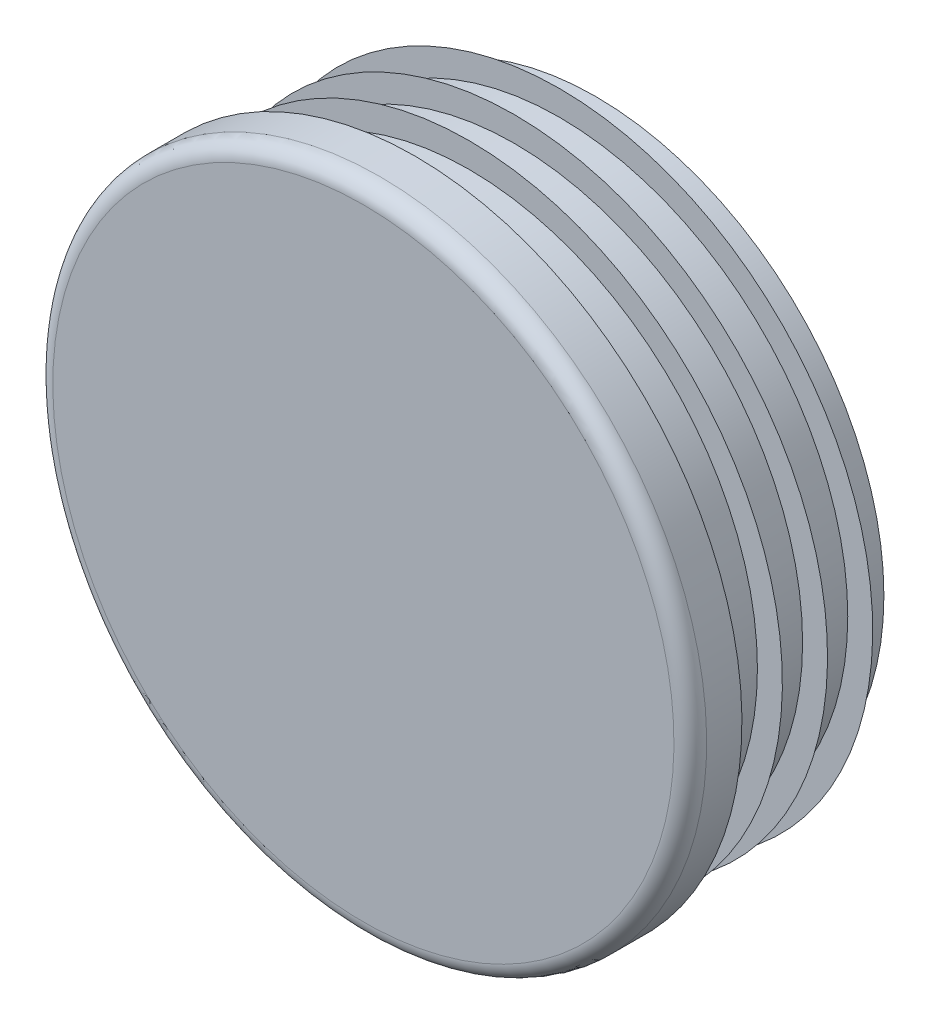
ISO-10303-21;
HEADER;
FILE_DESCRIPTION(('STEP AP214'),'2;1');
FILE_NAME('part.step','',(''),(''),'','','');
FILE_SCHEMA(('AUTOMOTIVE_DESIGN { 1 0 10303 214 1 1 1 1 }'));
ENDSEC;
DATA;
#1=APPLICATION_CONTEXT('core data for automotive mechanical design processes');
#2=APPLICATION_PROTOCOL_DEFINITION('international standard','automotive_design',2000,#1);
#3=PRODUCT_CONTEXT('',#1,'mechanical');
#4=PRODUCT('Part','Part','',(#3));
#5=PRODUCT_RELATED_PRODUCT_CATEGORY('part','',(#4));
#6=PRODUCT_DEFINITION_FORMATION('','',#4);
#7=PRODUCT_DEFINITION_CONTEXT('part definition',#1,'design');
#8=PRODUCT_DEFINITION('design','',#6,#7);
#9=PRODUCT_DEFINITION_SHAPE('','',#8);
#10=(LENGTH_UNIT() NAMED_UNIT(*) SI_UNIT(.MILLI.,.METRE.));
#11=(NAMED_UNIT(*) PLANE_ANGLE_UNIT() SI_UNIT($,.RADIAN.));
#12=(NAMED_UNIT(*) SI_UNIT($,.STERADIAN.) SOLID_ANGLE_UNIT());
#13=UNCERTAINTY_MEASURE_WITH_UNIT(LENGTH_MEASURE(1.E-05),#10,'distance_accuracy_value','');
#14=(GEOMETRIC_REPRESENTATION_CONTEXT(3) GLOBAL_UNCERTAINTY_ASSIGNED_CONTEXT((#13)) GLOBAL_UNIT_ASSIGNED_CONTEXT((#10,
#11,#12)) REPRESENTATION_CONTEXT('',''));
#15=CARTESIAN_POINT('',(0.,0.,0.));
#16=DIRECTION('',(0.,0.,1.));
#17=DIRECTION('',(1.,0.,0.));
#18=AXIS2_PLACEMENT_3D('',#15,#16,#17);
#19=CARTESIAN_POINT('',(0.,0.,6.));
#20=DIRECTION('',(0.,0.,-1.));
#21=DIRECTION('',(0.,1.,0.));
#22=AXIS2_PLACEMENT_3D('',#19,#20,#21);
#23=PLANE('',#22);
#24=CARTESIAN_POINT('',(0.,0.,6.));
#25=DIRECTION('',(0.,0.,-1.));
#26=DIRECTION('',(0.,1.,0.));
#27=AXIS2_PLACEMENT_3D('',#24,#25,#26);
#28=CIRCLE('',#27,36.1);
#29=CARTESIAN_POINT('',(0.,36.1,6.));
#30=VERTEX_POINT('',#29);
#31=EDGE_CURVE('E8',#30,#30,#28,.T.);
#32=ORIENTED_EDGE('',*,*,#31,.F.);
#33=EDGE_LOOP('',(#32));
#34=FACE_BOUND('',#33,.T.);
#35=ADVANCED_FACE('F12',(#34),#23,.F.);
#36=CARTESIAN_POINT('',(0.,0.,4.1));
#37=DIRECTION('',(0.,0.,-1.));
#38=DIRECTION('',(0.,1.,0.));
#39=AXIS2_PLACEMENT_3D('',#36,#37,#38);
#40=TOROIDAL_SURFACE('',#39,36.1,1.9);
#41=ORIENTED_EDGE('',*,*,#31,.T.);
#42=EDGE_LOOP('',(#41));
#43=FACE_BOUND('',#42,.T.);
#44=CARTESIAN_POINT('',(0.,0.,4.1000000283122));
#45=DIRECTION('',(0.,0.,-1.));
#46=DIRECTION('',(0.,1.,0.));
#47=AXIS2_PLACEMENT_3D('',#44,#45,#46);
#48=CIRCLE('',#47,38.);
#49=CARTESIAN_POINT('',(0.,38.,4.1000000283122));
#50=VERTEX_POINT('',#49);
#51=EDGE_CURVE('E18',#50,#50,#48,.T.);
#52=ORIENTED_EDGE('',*,*,#51,.F.);
#53=EDGE_LOOP('',(#52));
#54=FACE_BOUND('',#53,.T.);
#55=ADVANCED_FACE('F159',(#43,#54),#40,.T.);
#56=CARTESIAN_POINT('',(0.,0.,-21.));
#57=DIRECTION('',(0.,0.,-1.));
#58=DIRECTION('',(0.,1.,0.));
#59=AXIS2_PLACEMENT_3D('',#56,#57,#58);
#60=CYLINDRICAL_SURFACE('',#59,38.);
#61=CARTESIAN_POINT('',(0.,0.,0.));
#62=DIRECTION('',(0.,0.,-1.));
#63=DIRECTION('',(0.,1.,0.));
#64=AXIS2_PLACEMENT_3D('',#61,#62,#63);
#65=CIRCLE('',#64,38.);
#66=CARTESIAN_POINT('',(0.,38.,0.));
#67=VERTEX_POINT('',#66);
#68=EDGE_CURVE('E22',#67,#67,#65,.T.);
#69=ORIENTED_EDGE('',*,*,#68,.F.);
#70=EDGE_LOOP('',(#69));
#71=FACE_BOUND('',#70,.T.);
#72=ORIENTED_EDGE('',*,*,#51,.T.);
#73=EDGE_LOOP('',(#72));
#74=FACE_BOUND('',#73,.T.);
#75=ADVANCED_FACE('F154',(#71,#74),#60,.T.);
#76=CARTESIAN_POINT('',(38.,0.,0.));
#77=DIRECTION('',(0.,0.,1.));
#78=DIRECTION('',(0.,-1.,0.));
#79=AXIS2_PLACEMENT_3D('',#76,#77,#78);
#80=PLANE('',#79);
#81=CARTESIAN_POINT('',(0.,0.,0.));
#82=DIRECTION('',(0.,0.,-1.));
#83=DIRECTION('',(0.,1.,0.));
#84=AXIS2_PLACEMENT_3D('',#81,#82,#83);
#85=CIRCLE('',#84,33.5);
#86=CARTESIAN_POINT('',(0.,33.5,0.));
#87=VERTEX_POINT('',#86);
#88=EDGE_CURVE('E26',#87,#87,#85,.T.);
#89=ORIENTED_EDGE('',*,*,#88,.F.);
#90=EDGE_LOOP('',(#89));
#91=FACE_BOUND('',#90,.T.);
#92=ORIENTED_EDGE('',*,*,#68,.T.);
#93=EDGE_LOOP('',(#92));
#94=FACE_BOUND('',#93,.T.);
#95=ADVANCED_FACE('F148',(#91,#94),#80,.F.);
#96=CARTESIAN_POINT('',(0.,0.,-21.));
#97=DIRECTION('',(0.,0.,-1.));
#98=DIRECTION('',(0.,1.,0.));
#99=AXIS2_PLACEMENT_3D('',#96,#97,#98);
#100=CYLINDRICAL_SURFACE('',#99,33.5);
#101=CARTESIAN_POINT('',(0.,0.,-1.05));
#102=DIRECTION('',(0.,0.,-1.));
#103=DIRECTION('',(0.,1.,0.));
#104=AXIS2_PLACEMENT_3D('',#101,#102,#103);
#105=CIRCLE('',#104,33.5);
#106=CARTESIAN_POINT('',(0.,33.5,-1.05));
#107=VERTEX_POINT('',#106);
#108=EDGE_CURVE('E31',#107,#107,#105,.T.);
#109=ORIENTED_EDGE('',*,*,#108,.F.);
#110=EDGE_LOOP('',(#109));
#111=FACE_BOUND('',#110,.T.);
#112=ORIENTED_EDGE('',*,*,#88,.T.);
#113=EDGE_LOOP('',(#112));
#114=FACE_BOUND('',#113,.T.);
#115=ADVANCED_FACE('F142',(#111,#114),#100,.T.);
#116=CARTESIAN_POINT('',(33.5,0.,-1.05));
#117=DIRECTION('',(0.,0.,-1.));
#118=DIRECTION('',(0.,1.,0.));
#119=AXIS2_PLACEMENT_3D('',#116,#117,#118);
#120=PLANE('',#119);
#121=CARTESIAN_POINT('',(0.,0.,-1.05));
#122=DIRECTION('',(0.,0.,-1.));
#123=DIRECTION('',(0.,1.,0.));
#124=AXIS2_PLACEMENT_3D('',#121,#122,#123);
#125=CIRCLE('',#124,36.4);
#126=CARTESIAN_POINT('',(0.,36.4,-1.05));
#127=VERTEX_POINT('',#126);
#128=EDGE_CURVE('E34',#127,#127,#125,.T.);
#129=ORIENTED_EDGE('',*,*,#128,.F.);
#130=EDGE_LOOP('',(#129));
#131=FACE_BOUND('',#130,.T.);
#132=ORIENTED_EDGE('',*,*,#108,.T.);
#133=EDGE_LOOP('',(#132));
#134=FACE_BOUND('',#133,.T.);
#135=ADVANCED_FACE('F136',(#131,#134),#120,.F.);
#136=CARTESIAN_POINT('',(0.,0.,-1.05));
#137=DIRECTION('',(0.,0.,1.));
#138=DIRECTION('',(0.,-1.,0.));
#139=AXIS2_PLACEMENT_3D('',#136,#137,#138);
#140=CONICAL_SURFACE('',#139,36.4,0.959931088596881);
#141=CARTESIAN_POINT('',(0.,0.,-3.08060186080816));
#142=DIRECTION('',(0.,0.,-1.));
#143=DIRECTION('',(0.,1.,0.));
#144=AXIS2_PLACEMENT_3D('',#141,#142,#143);
#145=CIRCLE('',#144,33.5);
#146=CARTESIAN_POINT('',(0.,33.5,-3.08060186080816));
#147=VERTEX_POINT('',#146);
#148=EDGE_CURVE('E37',#147,#147,#145,.T.);
#149=ORIENTED_EDGE('',*,*,#148,.F.);
#150=EDGE_LOOP('',(#149));
#151=FACE_BOUND('',#150,.T.);
#152=ORIENTED_EDGE('',*,*,#128,.T.);
#153=EDGE_LOOP('',(#152));
#154=FACE_BOUND('',#153,.T.);
#155=ADVANCED_FACE('F130',(#151,#154),#140,.T.);
#156=CARTESIAN_POINT('',(0.,0.,-21.));
#157=DIRECTION('',(0.,0.,-1.));
#158=DIRECTION('',(0.,1.,0.));
#159=AXIS2_PLACEMENT_3D('',#156,#157,#158);
#160=CYLINDRICAL_SURFACE('',#159,33.5);
#161=CARTESIAN_POINT('',(0.,0.,-6.3));
#162=DIRECTION('',(0.,0.,-1.));
#163=DIRECTION('',(0.,1.,0.));
#164=AXIS2_PLACEMENT_3D('',#161,#162,#163);
#165=CIRCLE('',#164,33.5);
#166=CARTESIAN_POINT('',(0.,33.5,-6.3));
#167=VERTEX_POINT('',#166);
#168=EDGE_CURVE('E40',#167,#167,#165,.T.);
#169=ORIENTED_EDGE('',*,*,#168,.F.);
#170=EDGE_LOOP('',(#169));
#171=FACE_BOUND('',#170,.T.);
#172=ORIENTED_EDGE('',*,*,#148,.T.);
#173=EDGE_LOOP('',(#172));
#174=FACE_BOUND('',#173,.T.);
#175=ADVANCED_FACE('F124',(#171,#174),#160,.T.);
#176=CARTESIAN_POINT('',(33.5,0.,-6.3));
#177=DIRECTION('',(0.,0.,-1.));
#178=DIRECTION('',(0.,1.,0.));
#179=AXIS2_PLACEMENT_3D('',#176,#177,#178);
#180=PLANE('',#179);
#181=CARTESIAN_POINT('',(0.,0.,-6.3));
#182=DIRECTION('',(0.,0.,-1.));
#183=DIRECTION('',(0.,1.,0.));
#184=AXIS2_PLACEMENT_3D('',#181,#182,#183);
#185=CIRCLE('',#184,36.4);
#186=CARTESIAN_POINT('',(0.,36.4,-6.3));
#187=VERTEX_POINT('',#186);
#188=EDGE_CURVE('E43',#187,#187,#185,.T.);
#189=ORIENTED_EDGE('',*,*,#188,.F.);
#190=EDGE_LOOP('',(#189));
#191=FACE_BOUND('',#190,.T.);
#192=ORIENTED_EDGE('',*,*,#168,.T.);
#193=EDGE_LOOP('',(#192));
#194=FACE_BOUND('',#193,.T.);
#195=ADVANCED_FACE('F118',(#191,#194),#180,.F.);
#196=CARTESIAN_POINT('',(0.,0.,-6.3));
#197=DIRECTION('',(0.,0.,1.));
#198=DIRECTION('',(0.,-1.,0.));
#199=AXIS2_PLACEMENT_3D('',#196,#197,#198);
#200=CONICAL_SURFACE('',#199,36.4,0.959931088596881);
#201=CARTESIAN_POINT('',(0.,0.,-8.33060186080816));
#202=DIRECTION('',(0.,0.,-1.));
#203=DIRECTION('',(0.,1.,0.));
#204=AXIS2_PLACEMENT_3D('',#201,#202,#203);
#205=CIRCLE('',#204,33.5);
#206=CARTESIAN_POINT('',(0.,33.5,-8.33060186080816));
#207=VERTEX_POINT('',#206);
#208=EDGE_CURVE('E46',#207,#207,#205,.T.);
#209=ORIENTED_EDGE('',*,*,#208,.F.);
#210=EDGE_LOOP('',(#209));
#211=FACE_BOUND('',#210,.T.);
#212=ORIENTED_EDGE('',*,*,#188,.T.);
#213=EDGE_LOOP('',(#212));
#214=FACE_BOUND('',#213,.T.);
#215=ADVANCED_FACE('F112',(#211,#214),#200,.T.);
#216=CARTESIAN_POINT('',(0.,0.,-21.));
#217=DIRECTION('',(0.,0.,-1.));
#218=DIRECTION('',(0.,1.,0.));
#219=AXIS2_PLACEMENT_3D('',#216,#217,#218);
#220=CYLINDRICAL_SURFACE('',#219,33.5);
#221=CARTESIAN_POINT('',(0.,0.,-11.55));
#222=DIRECTION('',(0.,0.,-1.));
#223=DIRECTION('',(0.,1.,0.));
#224=AXIS2_PLACEMENT_3D('',#221,#222,#223);
#225=CIRCLE('',#224,33.5);
#226=CARTESIAN_POINT('',(0.,33.5,-11.55));
#227=VERTEX_POINT('',#226);
#228=EDGE_CURVE('E49',#227,#227,#225,.T.);
#229=ORIENTED_EDGE('',*,*,#228,.F.);
#230=EDGE_LOOP('',(#229));
#231=FACE_BOUND('',#230,.T.);
#232=ORIENTED_EDGE('',*,*,#208,.T.);
#233=EDGE_LOOP('',(#232));
#234=FACE_BOUND('',#233,.T.);
#235=ADVANCED_FACE('F106',(#231,#234),#220,.T.);
#236=CARTESIAN_POINT('',(33.5,0.,-11.55));
#237=DIRECTION('',(0.,0.,-1.));
#238=DIRECTION('',(0.,1.,0.));
#239=AXIS2_PLACEMENT_3D('',#236,#237,#238);
#240=PLANE('',#239);
#241=CARTESIAN_POINT('',(0.,0.,-11.55));
#242=DIRECTION('',(0.,0.,-1.));
#243=DIRECTION('',(0.,1.,0.));
#244=AXIS2_PLACEMENT_3D('',#241,#242,#243);
#245=CIRCLE('',#244,36.4);
#246=CARTESIAN_POINT('',(0.,36.4,-11.55));
#247=VERTEX_POINT('',#246);
#248=EDGE_CURVE('E52',#247,#247,#245,.T.);
#249=ORIENTED_EDGE('',*,*,#248,.F.);
#250=EDGE_LOOP('',(#249));
#251=FACE_BOUND('',#250,.T.);
#252=ORIENTED_EDGE('',*,*,#228,.T.);
#253=EDGE_LOOP('',(#252));
#254=FACE_BOUND('',#253,.T.);
#255=ADVANCED_FACE('F100',(#251,#254),#240,.F.);
#256=CARTESIAN_POINT('',(0.,0.,-11.55));
#257=DIRECTION('',(0.,0.,1.));
#258=DIRECTION('',(0.,-1.,0.));
#259=AXIS2_PLACEMENT_3D('',#256,#257,#258);
#260=CONICAL_SURFACE('',#259,36.4,0.959931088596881);
#261=CARTESIAN_POINT('',(0.,0.,-13.5806018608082));
#262=DIRECTION('',(0.,0.,-1.));
#263=DIRECTION('',(0.,1.,0.));
#264=AXIS2_PLACEMENT_3D('',#261,#262,#263);
#265=CIRCLE('',#264,33.5);
#266=CARTESIAN_POINT('',(0.,33.5,-13.5806018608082));
#267=VERTEX_POINT('',#266);
#268=EDGE_CURVE('E55',#267,#267,#265,.T.);
#269=ORIENTED_EDGE('',*,*,#268,.F.);
#270=EDGE_LOOP('',(#269));
#271=FACE_BOUND('',#270,.T.);
#272=ORIENTED_EDGE('',*,*,#248,.T.);
#273=EDGE_LOOP('',(#272));
#274=FACE_BOUND('',#273,.T.);
#275=ADVANCED_FACE('F94',(#271,#274),#260,.T.);
#276=CARTESIAN_POINT('',(0.,0.,-21.));
#277=DIRECTION('',(0.,0.,-1.));
#278=DIRECTION('',(0.,1.,0.));
#279=AXIS2_PLACEMENT_3D('',#276,#277,#278);
#280=CYLINDRICAL_SURFACE('',#279,33.5);
#281=CARTESIAN_POINT('',(0.,0.,-16.8));
#282=DIRECTION('',(0.,0.,-1.));
#283=DIRECTION('',(0.,1.,0.));
#284=AXIS2_PLACEMENT_3D('',#281,#282,#283);
#285=CIRCLE('',#284,33.5);
#286=CARTESIAN_POINT('',(0.,33.5,-16.8));
#287=VERTEX_POINT('',#286);
#288=EDGE_CURVE('E58',#287,#287,#285,.T.);
#289=ORIENTED_EDGE('',*,*,#288,.F.);
#290=EDGE_LOOP('',(#289));
#291=FACE_BOUND('',#290,.T.);
#292=ORIENTED_EDGE('',*,*,#268,.T.);
#293=EDGE_LOOP('',(#292));
#294=FACE_BOUND('',#293,.T.);
#295=ADVANCED_FACE('F88',(#291,#294),#280,.T.);
#296=CARTESIAN_POINT('',(33.5,0.,-16.8));
#297=DIRECTION('',(0.,0.,-1.));
#298=DIRECTION('',(0.,1.,0.));
#299=AXIS2_PLACEMENT_3D('',#296,#297,#298);
#300=PLANE('',#299);
#301=CARTESIAN_POINT('',(0.,0.,-16.8));
#302=DIRECTION('',(0.,0.,-1.));
#303=DIRECTION('',(0.,1.,0.));
#304=AXIS2_PLACEMENT_3D('',#301,#302,#303);
#305=CIRCLE('',#304,36.4);
#306=CARTESIAN_POINT('',(0.,36.4,-16.8));
#307=VERTEX_POINT('',#306);
#308=EDGE_CURVE('E61',#307,#307,#305,.T.);
#309=ORIENTED_EDGE('',*,*,#308,.F.);
#310=EDGE_LOOP('',(#309));
#311=FACE_BOUND('',#310,.T.);
#312=ORIENTED_EDGE('',*,*,#288,.T.);
#313=EDGE_LOOP('',(#312));
#314=FACE_BOUND('',#313,.T.);
#315=ADVANCED_FACE('F82',(#311,#314),#300,.F.);
#316=CARTESIAN_POINT('',(0.,0.,-16.8));
#317=DIRECTION('',(0.,0.,1.));
#318=DIRECTION('',(0.,-1.,0.));
#319=AXIS2_PLACEMENT_3D('',#316,#317,#318);
#320=CONICAL_SURFACE('',#319,36.4,0.959931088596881);
#321=CARTESIAN_POINT('',(0.,0.,-18.8306018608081));
#322=DIRECTION('',(0.,0.,-1.));
#323=DIRECTION('',(0.,1.,0.));
#324=AXIS2_PLACEMENT_3D('',#321,#322,#323);
#325=CIRCLE('',#324,33.5);
#326=CARTESIAN_POINT('',(0.,33.5,-18.8306018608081));
#327=VERTEX_POINT('',#326);
#328=EDGE_CURVE('E64',#327,#327,#325,.T.);
#329=ORIENTED_EDGE('',*,*,#328,.F.);
#330=EDGE_LOOP('',(#329));
#331=FACE_BOUND('',#330,.T.);
#332=ORIENTED_EDGE('',*,*,#308,.T.);
#333=EDGE_LOOP('',(#332));
#334=FACE_BOUND('',#333,.T.);
#335=ADVANCED_FACE('F76',(#331,#334),#320,.T.);
#336=CARTESIAN_POINT('',(0.,0.,-21.));
#337=DIRECTION('',(0.,0.,-1.));
#338=DIRECTION('',(0.,1.,0.));
#339=AXIS2_PLACEMENT_3D('',#336,#337,#338);
#340=CYLINDRICAL_SURFACE('',#339,33.5);
#341=CARTESIAN_POINT('',(0.,0.,-21.));
#342=DIRECTION('',(0.,0.,-1.));
#343=DIRECTION('',(0.,1.,0.));
#344=AXIS2_PLACEMENT_3D('',#341,#342,#343);
#345=CIRCLE('',#344,33.5);
#346=CARTESIAN_POINT('',(0.,33.5,-21.));
#347=VERTEX_POINT('',#346);
#348=EDGE_CURVE('E67',#347,#347,#345,.T.);
#349=ORIENTED_EDGE('',*,*,#348,.F.);
#350=EDGE_LOOP('',(#349));
#351=FACE_BOUND('',#350,.T.);
#352=ORIENTED_EDGE('',*,*,#328,.T.);
#353=EDGE_LOOP('',(#352));
#354=FACE_BOUND('',#353,.T.);
#355=ADVANCED_FACE('F73',(#351,#354),#340,.T.);
#356=CARTESIAN_POINT('',(33.5,0.,-21.));
#357=DIRECTION('',(0.,0.,1.));
#358=DIRECTION('',(0.,-1.,0.));
#359=AXIS2_PLACEMENT_3D('',#356,#357,#358);
#360=PLANE('',#359);
#361=ORIENTED_EDGE('',*,*,#348,.T.);
#362=EDGE_LOOP('',(#361));
#363=FACE_BOUND('',#362,.T.);
#364=ADVANCED_FACE('F71',(#363),#360,.F.);
#365=CLOSED_SHELL('',(#35,#55,#75,#95,#115,#135,#155,#175,#195,#215,#235,#255,#275,#295,#315,
#335,#355,#364));
#366=MANIFOLD_SOLID_BREP('B1',#365);
#367=ADVANCED_BREP_SHAPE_REPRESENTATION('',(#18,#366),#14);
#368=SHAPE_DEFINITION_REPRESENTATION(#9,#367);
ENDSEC;
END-ISO-10303-21;
